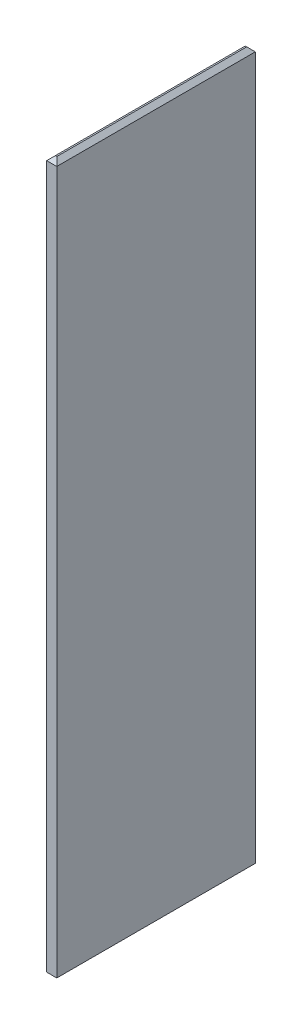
from build123d import *

# Parameters (mm, degrees)
SKETCH1_W           = 152.4
SKETCH1_H           = 3000
BOSS_EXTRUDE1_DEPTH = 10749.8
CHAMFER1_SIZE       = 65


with BuildPart() as part:
    # Sketch1 → Boss-Extrude1 (new body)
    with BuildSketch(Plane(origin=(0, 0, 0), x_dir=(-1, 0, 0), z_dir=(0, 1, 0))):
        Rectangle(SKETCH1_W, SKETCH1_H)
    extrude(amount=BOSS_EXTRUDE1_DEPTH)

    # Chamfer1
    chamfer1_edges = [part.edges().sort_by_distance(p)[0] for p in [
        (76.2, 10749.8, 0),
        (0, 10749.8, -1500),
        (-76.2, 10749.8, 0),
        (0, 0, -1500),
        (76.2, 0, 0),
        (0, 0, 1500),
        (-76.2, 0, 0),
        (0, 10749.8, 1500),
    ]]
    chamfer(chamfer1_edges, length=CHAMFER1_SIZE)


solid = part.part
